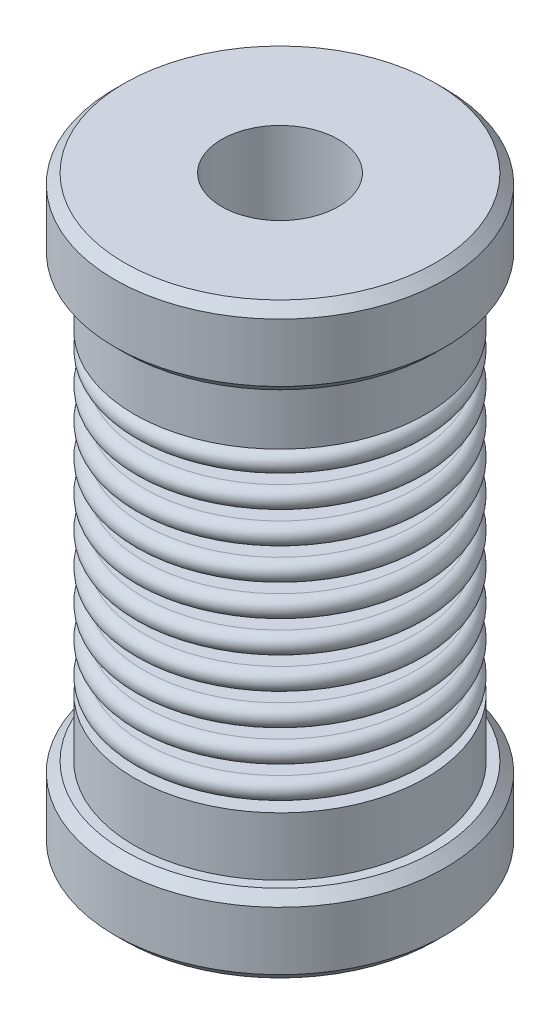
from build123d import *

# Parameters (mm, degrees)
R_P_TITION_LIN_AIRE1_COUNT = 10
R_P_TITION_LIN_AIRE1_PITCH = 1.62
CHANFREIN1_SIZE            = 0.5


with BuildPart() as part:
    # Esquisse1 → Base-R_volution (revolve)
    with BuildSketch(Plane.XY, mode=Mode.PRIVATE) as base_r_volution_sk:
        Polygon((3, 0), (3, -30.2), (8.5, -30.2), (8.5, -26.2), (7.5, -26.2), (7.5, -23.2), (5.5, -23.2), (5.5, -7), (7.5, -7), (7.5, -4), (8.5, -4), (8.5, 0), align=None)
    revolve(base_r_volution_sk.sketch.rotate(Axis((0, -34.787873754, 0), (0, 1, 0)), 270), axis=Axis((0, -34.787873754, 0), (0, 1, 0)))

    # Esquisse2 → Boss.-R_vol.1 (revolve)
    with BuildSketch(Plane(origin=(0, 0, 0), x_dir=(0, 0, -1), z_dir=(1, 0, 0)), mode=Mode.PRIVATE) as boss_r_vol_1_sk:
        with BuildLine():
            Line((5.5, -7.31), (5.5, -8.31))
            Line((5.5, -8.31), (7, -8.31))
            ThreePointArc((7, -8.31), (7.5, -7.81), (7, -7.31))
            Line((7, -7.31), (5.5, -7.31))
        make_face()
    boss_r_vol_1 = revolve(boss_r_vol_1_sk.sketch.rotate(Axis((0, -6.070099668, 0), (0, -1, 0)), 180), axis=Axis((0, -6.070099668, 0), (0, -1, 0)))

    # R_p_tition lin_aire1: Boss.-R_vol.1 ×10
    with Locations(*[(0, -i * R_P_TITION_LIN_AIRE1_PITCH, 0) for i in range(1, R_P_TITION_LIN_AIRE1_COUNT)]):
        add(boss_r_vol_1)

    # Chanfrein1
    chanfrein1_edges = [part.edges().sort_by_distance(p)[0] for p in [
        (0, 0, -8.5),
        (0, -30.2, -8.5),
        (0, -4, -8.5),
        (0, -26.2, -8.5),
    ]]
    chamfer(chanfrein1_edges, length=CHANFREIN1_SIZE)


solid = part.part
